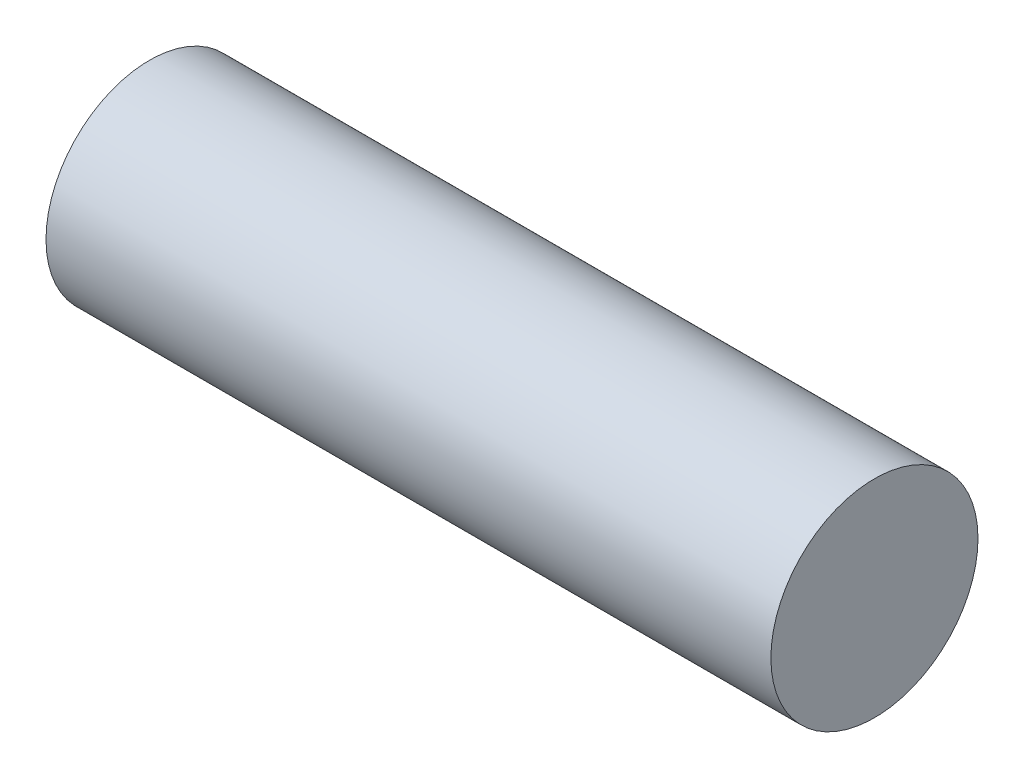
from build123d import *

# Parameters (mm, degrees)
SKETCH1_R      = 12.7
EXTRUDE1_DEPTH = 44.45


with BuildPart() as part:
    # Sketch1 → Extrude1 (new, symmetric)
    with BuildSketch(Plane(origin=(0, 0, 0), x_dir=(0, 0, -1), z_dir=(1, 0, 0))):
        Circle(SKETCH1_R)
    extrude(amount=EXTRUDE1_DEPTH, both=True)


solid = part.part
